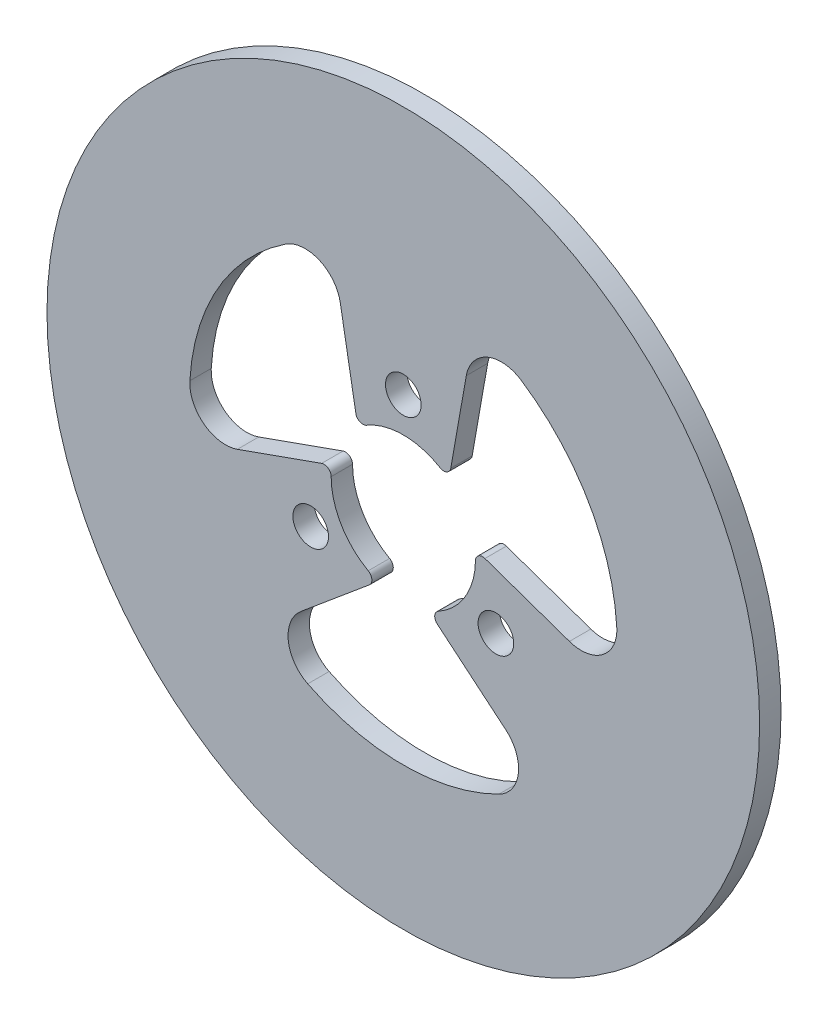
from build123d import *

# Parameters (mm, degrees)
ESQUISSE1_R          = 100
ESQUISSE1_R_2        = 5
BASE_EXTRUSION_DEPTH = 6


with BuildPart() as part:
    # Esquisse1 → Base-Extrusion (new body)
    with BuildSketch(Plane.XY):
        Circle(ESQUISSE1_R)
        with Locations((0, 30)):
            Circle(ESQUISSE1_R_2, mode=Mode.SUBTRACT)
        with Locations((-25.980762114, -15)):
            Circle(ESQUISSE1_R_2, mode=Mode.SUBTRACT)
        with Locations((25.980762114, -15)):
            Circle(ESQUISSE1_R_2, mode=Mode.SUBTRACT)
        with BuildLine():
            Line((-9.532448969, -20.979076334), (-28.762610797, -37.055075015))
            ThreePointArc((-28.762610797, -37.055075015), (-32.28106305, -45.889244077), (-26.818558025, -53.672757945))
            ThreePointArc((-26.818558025, -53.672757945), (0, -60), (26.818558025, -53.672757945))
            ThreePointArc((26.818558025, -53.672757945), (32.28106305, -45.889244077), (28.762610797, -37.055075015))
            Line((28.762610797, -37.055075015), (9.532448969, -20.979076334))
            ThreePointArc((9.532448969, -20.979076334), (8.824106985, -19.256209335), (9.843057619, -17.696799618))
            ThreePointArc((9.843057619, -17.696799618), (17.402179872, -10.355029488), (20.248919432, -0.20919331))
            ThreePointArc((20.248919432, -0.20919331), (21.099841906, 1.407175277), (22.909211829, 1.657967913))
            Line((22.909211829, 1.657967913), (46.619387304, -6.63633982))
            ThreePointArc((46.619387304, -6.63633982), (55.934830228, -5.187125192), (59.905659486, 3.363325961))
            ThreePointArc((59.905659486, 3.363325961), (52.010639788, 29.914768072), (33.029979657, 50.090123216))
            ThreePointArc((33.029979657, 50.090123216), (23.570709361, 50.926741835), (17.677313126, 43.480561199))
            Line((17.677313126, 43.480561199), (13.317842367, 18.790642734))
            ThreePointArc((13.317842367, 18.790642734), (12.182778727, 17.320803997), (10.328235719, 17.418095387))
            ThreePointArc((10.328235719, 17.418095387), (0, 20.25), (-10.328235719, 17.418095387))
            ThreePointArc((-10.328235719, 17.418095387), (-12.182778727, 17.320803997), (-13.317842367, 18.790642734))
            Line((-13.317842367, 18.790642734), (-17.677313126, 43.480561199))
            ThreePointArc((-17.677313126, 43.480561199), (-23.570709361, 50.926741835), (-33.029979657, 50.090123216))
            ThreePointArc((-33.029979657, 50.090123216), (-51.989558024, 29.951391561), (-59.9008625, 3.447705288))
            ThreePointArc((-59.9008625, 3.447705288), (-55.916698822, -5.12742716), (-46.568761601, -6.549582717))
            Line((-46.568761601, -6.549582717), (-22.919704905, 1.854806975))
            ThreePointArc((-22.919704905, 1.854806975), (-21.097696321, 1.604972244), (-20.249981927, -0.027055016))
            ThreePointArc((-20.249981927, -0.027055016), (-17.448573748, -10.276661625), (-9.843057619, -17.696799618))
            ThreePointArc((-9.843057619, -17.696799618), (-8.824106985, -19.256209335), (-9.532448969, -20.979076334))
        make_face(mode=Mode.SUBTRACT)
    extrude(amount=BASE_EXTRUSION_DEPTH)


solid = part.part
